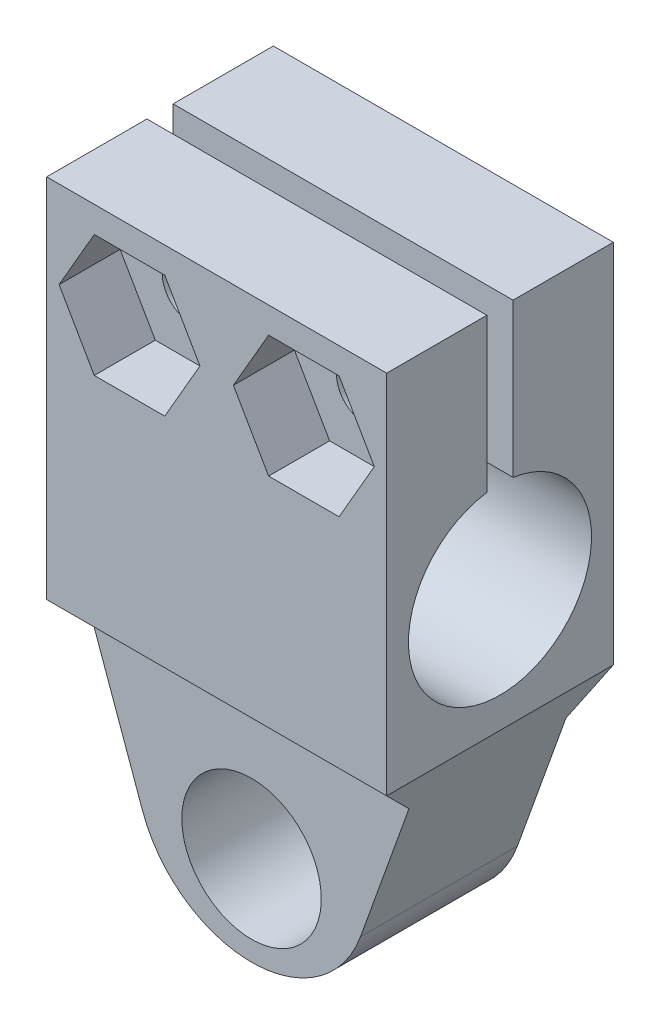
from build123d import *

# Parameters (mm, degrees)
BASE_EXTRUSION_DEPTH     = 26
ENL_V_MAT_EXTRU_2_DEPTH  = 39
ESQUISSE3_R              = 3.25
ENL_V_MAT_EXTRU_7_DEPTH  = 63.93647591
ESQUISSE4_R              = 7.5
ENL_V_MAT_EXTRU_10_DEPTH = 7
ENL_V_MAT_EXTRU_11_DEPTH = 7
ESQUISSE7_R              = 8
ENL_V_MAT_EXTRU_12_DEPTH = 62.392181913


with BuildPart() as part:
    # Esquisse1 → Base-Extrusion (new body)
    with BuildSketch(Plane.XY):
        with BuildLine():
            Line((0, 0), (7, -19.489578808))
            ThreePointArc((7, -19.489578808), (19.5, -28.281804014), (32, -19.489578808))
            Line((32, -19.489578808), (39, 0))
            Line((39, 0), (39, 42))
            Line((39, 42), (0, 42))
            Line((0, 42), (0, 0))
        make_face()
    extrude(amount=BASE_EXTRUSION_DEPTH)

    # Esquisse2 → Enl_v. mat.-Extru.2 (cut)
    with BuildSketch(Plane(origin=(39, 0, 0), x_dir=(0, 0, -1), z_dir=(1, 0, 0))):
        Polygon((-26, 0), (-22, -4), (-22, -49.738376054), (-4, -49.738376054), (-4, -4), (0, 0), (34.639884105, -4.870132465), (23.843417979, -81.662363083), (-91.727534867, -65.413871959), align=None)
        with BuildLine():
            Line((-14.5, 24.392304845), (-14.5, 51.866157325))
            Line((-14.5, 51.866157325), (-11.5, 51.866157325))
            Line((-11.5, 51.866157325), (-11.5, 24.392304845))
            ThreePointArc((-11.5, 24.392304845), (-13, 3.5), (-14.5, 24.392304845))
        make_face()
    extrude(amount=-ENL_V_MAT_EXTRU_2_DEPTH, mode=Mode.SUBTRACT)

    # Esquisse3 → Enl_v. mat.-Extru.7 (cut, through all)
    with BuildSketch(Plane(origin=(0, 0, 0), x_dir=(-1, 0, 0), z_dir=(0, 0, -1))):
        with Locations((-29.5, 32)):
            Circle(ESQUISSE3_R)
        with Locations((-9.5, 32)):
            Circle(ESQUISSE3_R)
    extrude(amount=-ENL_V_MAT_EXTRU_7_DEPTH, mode=Mode.SUBTRACT)

    # Esquisse4 → Enl_v. mat.-Extru.10 (cut)
    with BuildSketch(Plane(origin=(0, 0, 0), x_dir=(-1, 0, 0), z_dir=(0, 0, -1))):
        with Locations((-29.5, 32)):
            Circle(ESQUISSE4_R)
        with Locations((-9.5, 32)):
            Circle(ESQUISSE4_R)
    extrude(amount=-ENL_V_MAT_EXTRU_10_DEPTH, mode=Mode.SUBTRACT)

    # Esquisse5 → Enl_v. mat.-Extru.11 (cut)
    with BuildSketch(Plane.XY.offset(26)):
        Polygon((33.541451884, 25), (37.582903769, 32), (33.541451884, 39), (25.458548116, 39), (21.417096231, 32), (25.458548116, 25), align=None)
        Polygon((13.541451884, 25), (17.582903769, 32), (13.541451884, 39), (5.458548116, 39), (1.417096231, 32), (5.458548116, 25), align=None)
    extrude(amount=-ENL_V_MAT_EXTRU_11_DEPTH, mode=Mode.SUBTRACT)

    # Esquisse7 → Enl_v. mat.-Extru.12 (cut, through all)
    with BuildSketch(Plane(origin=(0, 0, 4), x_dir=(-1, 0, 0), z_dir=(0, 0, -1))):
        with Locations((-19.5, -18)):
            Circle(ESQUISSE7_R)
    extrude(amount=-ENL_V_MAT_EXTRU_12_DEPTH, mode=Mode.SUBTRACT)


solid = part.part
